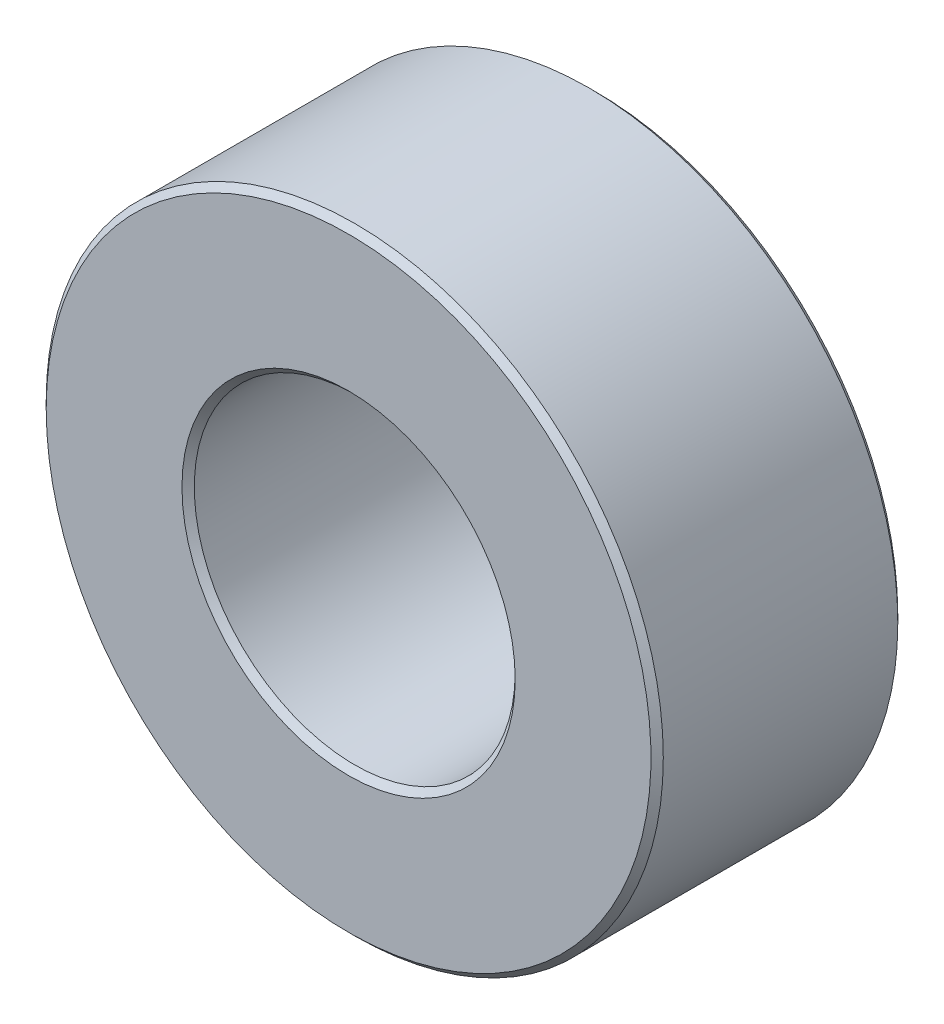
from build123d import *

# Parameters (mm, degrees)
SKETCH1_R           = 5
SKETCH1_R_2         = 2.6
BOSS_EXTRUDE2_DEPTH = 2
CHAMFER3_SIZE       = 0.1


with BuildPart() as part:
    # Sketch1 → Boss-Extrude2 (new, symmetric)
    with BuildSketch(Plane.XY):
        Circle(SKETCH1_R)
        Circle(SKETCH1_R_2, mode=Mode.SUBTRACT)
    extrude(amount=BOSS_EXTRUDE2_DEPTH, both=True)

    # Chamfer3
    chamfer3_edges = [part.edges().sort_by_distance(p)[0] for p in [
        (-5, 0, -2),
        (-5, 0, 2),
        (-2.6, 0, -2),
        (-2.6, 0, 2),
    ]]
    chamfer(chamfer3_edges, length=CHAMFER3_SIZE)


solid = part.part
